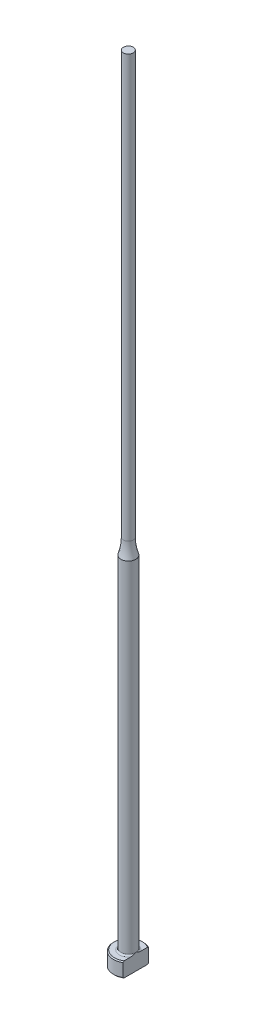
from build123d import *
from build123d.topology import SkipClean

# Parameters (mm, degrees)
CHAMFER1_SIZE = 0.2
FILLET1_R     = 0.3
KEY_DEPTH     = 161.056240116


with BuildPart() as part:
    # Sketch1 → Revolve1 (revolve)
    with BuildSketch(Plane.XY, mode=Mode.PRIVATE) as revolve1_sk:
        with BuildLine():
            Line((0, 0), (-3, 0))
            Line((-3, 0), (-3, 3))
            Line((-3, 3), (-1.5, 3))
            Line((-1.5, 3), (-1.5, 71.877501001))
            ThreePointArc((-1.5, 71.877501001), (-1.125791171, 73.41886117), (-1, 75))
            Line((-1, 75), (-1, 160))
            Line((-1, 160), (0, 160))
            Line((0, 160), (0, 0))
        make_face()
    revolve(revolve1_sk.sketch.rotate(Axis((0, 259.958771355, 0), (0, -1, 0)), 270), axis=Axis((0, 259.958771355, 0), (0, -1, 0)))

    # Chamfer1
    chamfer1_edges = [part.edges().sort_by_distance(p)[0] for p in [
        (0, 0, -3),
        (0, 3, -3),
    ]]
    chamfer(chamfer1_edges, length=CHAMFER1_SIZE)

    # Fillet1
    fillet1_edges = [part.edges().sort_by_distance(p)[0] for p in [
        (0, 3, -1.5),
    ]]
    fillet(fillet1_edges, radius=FILLET1_R)

    # Sketch2 → KEY (cut, through all)
    with SkipClean():  # the faces are left unmerged after this step: merging them gives an invalid solid
        with BuildSketch(Plane(origin=(0, 0, 0), x_dir=(1, 0, 0), z_dir=(0, 1, 0))):
            with BuildLine():
                Line((1.5, 2.598076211), (1.5, -2.598076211))
                ThreePointArc((1.5, -2.598076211), (3, 0), (1.5, 2.598076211))
            make_face()
        extrude(amount=KEY_DEPTH, mode=Mode.SUBTRACT)


solid = part.part
